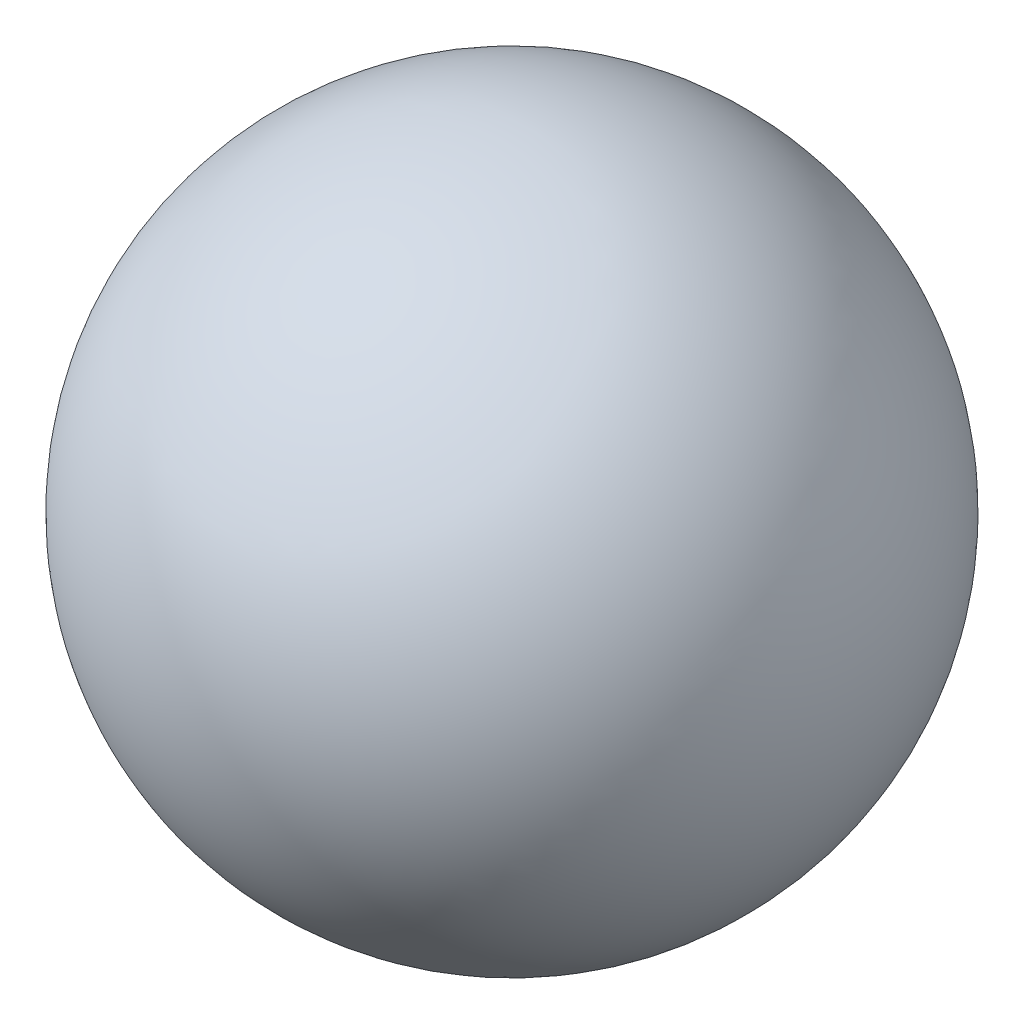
from build123d import *


with BuildPart() as part:
    # Sketch1 → Revolve8 (revolve)
    with BuildSketch(Plane(origin=(0, 0, 0), x_dir=(1, 0, 0), z_dir=(0, 1, 0))):
        with BuildLine():
            Line((0, 1.5), (0, -1.5))
            ThreePointArc((0, -1.5), (-1.5, 0), (0, 1.5))
        make_face()
    revolve(axis=Axis((0, 0, -1.5), (0, 0, 1)))


solid = part.part
